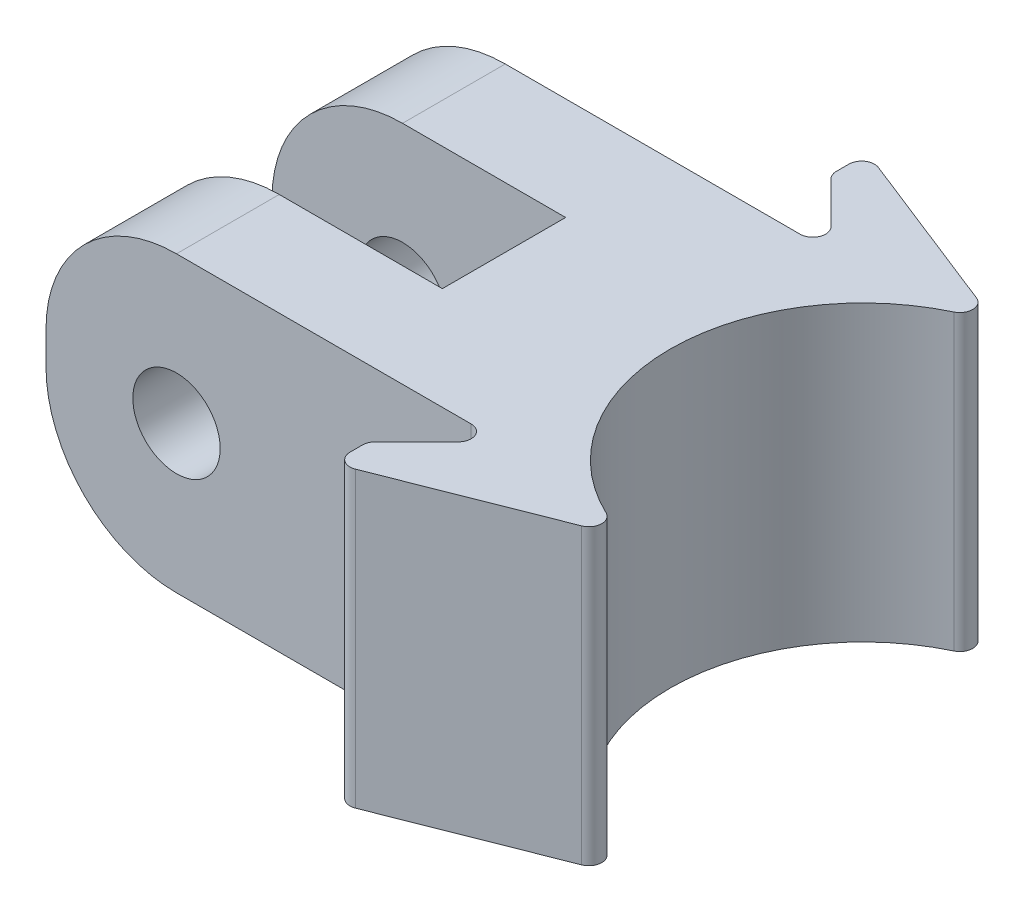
from build123d import *

# Parameters (mm, degrees)
BOSS_EXTRUDE1_DEPTH     = 11.43
FILLET1_R               = 5.08
M3_CLEARANCE_HOLE1_D    = 3.4
CUT_EXTRUDE1_DEPTH      = 21.853868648
CUT_EXTRUDE1_DEPTH_BACK = 21.853868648
SKETCH5_R               = 7.5
FILLET2_R               = 0.5


with BuildPart() as part:
    # Sketch1 → Boss-Extrude1 (new body)
    with BuildSketch(Plane(origin=(0, 0, 0), x_dir=(1, 0, 0), z_dir=(0, 1, 0))):
        Polygon((-11.43, 2.4), (0, 2.4), (0, -2.4), (-11.43, -2.4), (-11.43, -6.4), (6.329871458, -6.4), (3.714801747, -9.015069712), (3.714801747, -10.444043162), (13.97, -6.4), (13.97, 6.4), (3.714801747, 10.444043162), (3.714801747, 9.015069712), (6.329871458, 6.4), (-11.43, 6.4), align=None)
    extrude(amount=BOSS_EXTRUDE1_DEPTH)

    # Fillet1
    fillet1_edges = [part.edges().sort_by_distance(p)[0] for p in [
        (-11.43, 0, 4.4),
        (-11.43, 0, -4.4),
        (-11.43, 11.43, 4.4),
        (-11.43, 11.43, -4.4),
    ]]
    fillet(fillet1_edges, radius=FILLET1_R)

    # M3 Clearance Hole1 (through all)
    with Locations(Plane.XY.offset(6.4)):
        with Locations((-6.35, 5.715)):
            Hole(M3_CLEARANCE_HOLE1_D / 2)

    # Sketch5 → Cut-Extrude1 (cut, two sides: drawn at the far end of the back side and taken through both)
    with BuildSketch(Plane(origin=(0, 11.43, 0), x_dir=(1, 0, 0), z_dir=(0, 1, 0)).offset(-CUT_EXTRUDE1_DEPTH_BACK)):
        with Locations((13.97, 0)):
            Circle(SKETCH5_R)
    extrude(amount=CUT_EXTRUDE1_DEPTH + CUT_EXTRUDE1_DEPTH_BACK, mode=Mode.SUBTRACT)

    # Fillet2
    fillet2_edges = [part.edges().sort_by_distance(p)[0] for p in [
        (6.329871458, 5.715, -6.4),
        (3.714801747, 5.715, -9.015069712),
        (3.714801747, 5.715, -10.444043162),
        (3.714801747, 5.715, 10.444043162),
        (3.714801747, 5.715, 9.015069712),
        (6.329871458, 5.715, 6.4),
        (11.911170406, 5.715, 7.211880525),
        (11.911170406, 5.715, -7.211880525),
    ]]
    fillet(fillet2_edges, radius=FILLET2_R)


solid = part.part
